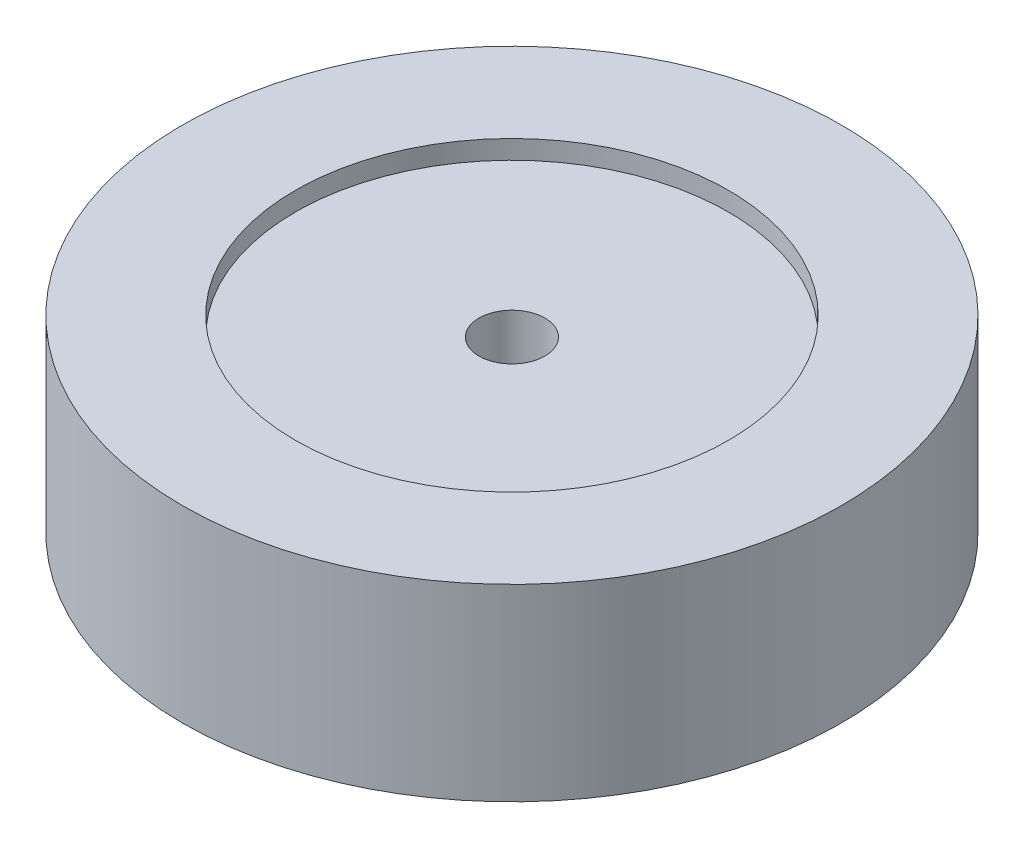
from build123d import *

# Parameters (mm, degrees)
SKETCH1_R          = 17.5
SKETCH1_R_2        = 1.75
EXTRUDE1_DEPTH     = 10
SKETCH2_R          = 11.5
CUT_EXTRUDE1_DEPTH = 1


with BuildPart() as part:
    # Sketch1 → Extrude1 (new body)
    with BuildSketch(Plane(origin=(0, 0, 0), x_dir=(1, 0, 0), z_dir=(0, 1, 0))):
        with Locations(Location((0, 0, 0), (0, 0, 270))):
            Circle(SKETCH1_R)
        with Locations(Location((0, 0, 0), (0, 0, 270))):
            Circle(SKETCH1_R_2, mode=Mode.SUBTRACT)
    extrude(amount=EXTRUDE1_DEPTH)

    # Sketch2 → Cut-Extrude1 (cut)
    with BuildSketch(Plane(origin=(0, 10, 0), x_dir=(-1, 0, 0), z_dir=(0, 1, 0))):
        with Locations(Location((0, 0, 0), (0, 0, 90))):
            Circle(SKETCH2_R)
    extrude(amount=-CUT_EXTRUDE1_DEPTH, mode=Mode.SUBTRACT)


solid = part.part
